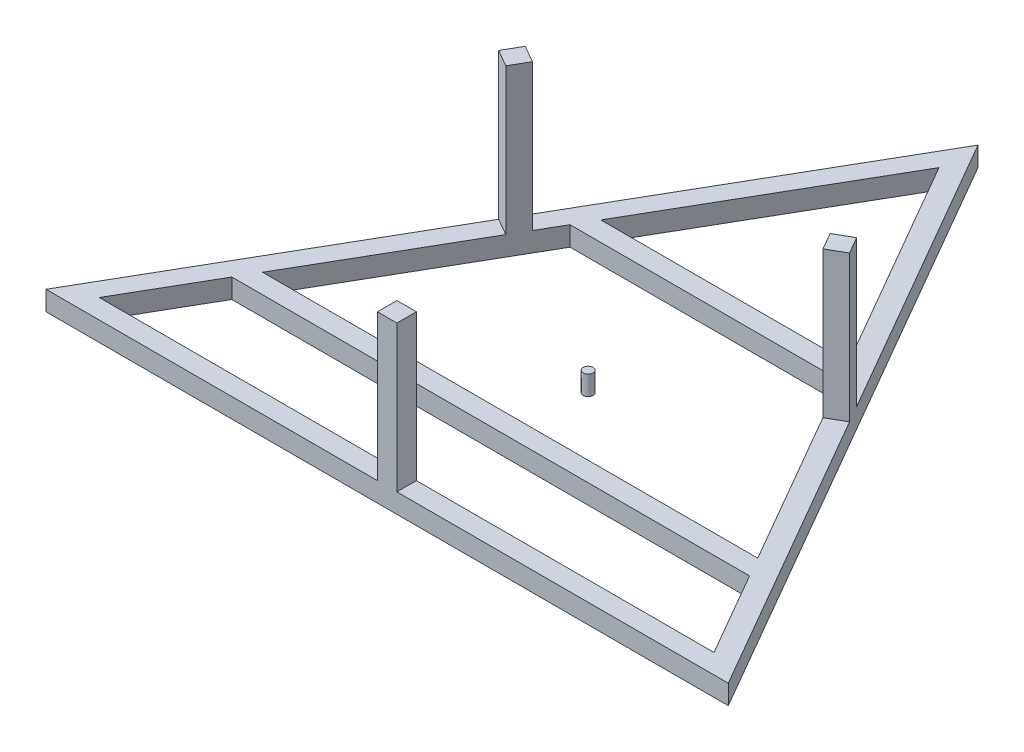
from build123d import *

# Parameters (mm, degrees)
EXTRUDE_1_DEPTH = 20
SKETCH_2_W      = 20
SKETCH_2_H      = 20
EXTRUDE_2_DEPTH = 150
SKETCH_3_R      = 5
EXTRUDE_3_DEPTH = 20


with BuildPart() as part:
    # Sketch 1 → Extrude 1 (new body)
    with BuildSketch(Plane(origin=(0, 0, 0), x_dir=(1, 0, 0), z_dir=(0, 1, 0))):
        Polygon((-350, -206.217782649), (350, -206.217782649), (0, 400), align=None)
        Polygon((315.358983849, -186.217782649), (265.581123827, -100), (-265.581123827, -100), (-315.358983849, -186.217782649), align=None, mode=Mode.SUBTRACT)
        Polygon((0, 360), (-127.017059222, 140), (127.017059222, 140), align=None, mode=Mode.SUBTRACT)
        Polygon((-254.034118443, -80), (254.034118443, -80), (138.564064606, 120), (-138.564064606, 120), align=None, mode=Mode.SUBTRACT)
    extrude(amount=EXTRUDE_1_DEPTH)

    # Sketch 2 → Extrude 2 (add)
    with BuildSketch(Plane(origin=(0, 20, 0), x_dir=(1, 0, 0), z_dir=(0, 1, 0))):
        Polygon((-152.679491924, 95.551362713), (-170, 105.551362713), (-180, 88.230854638), (-162.679491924, 78.230854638), align=None)
        Polygon((170, 105.551362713), (152.679491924, 95.551362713), (162.679491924, 78.230854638), (180, 88.230854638), align=None)
        with Locations((0, -196.217782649)):
            Rectangle(SKETCH_2_W, SKETCH_2_H)
    extrude(amount=EXTRUDE_2_DEPTH)


with BuildPart() as body_2:
    # Sketch 3 → Extrude 3 (new body)
    with BuildSketch(Plane(origin=(0, 20, 0), x_dir=(1, 0, 0), z_dir=(0, 1, 0))):
        with Locations(Location((0, 0, 0), (0, 0, 270))):
            Circle(SKETCH_3_R)
    extrude(amount=-EXTRUDE_3_DEPTH)


solid = Compound([part.part, body_2.part])
